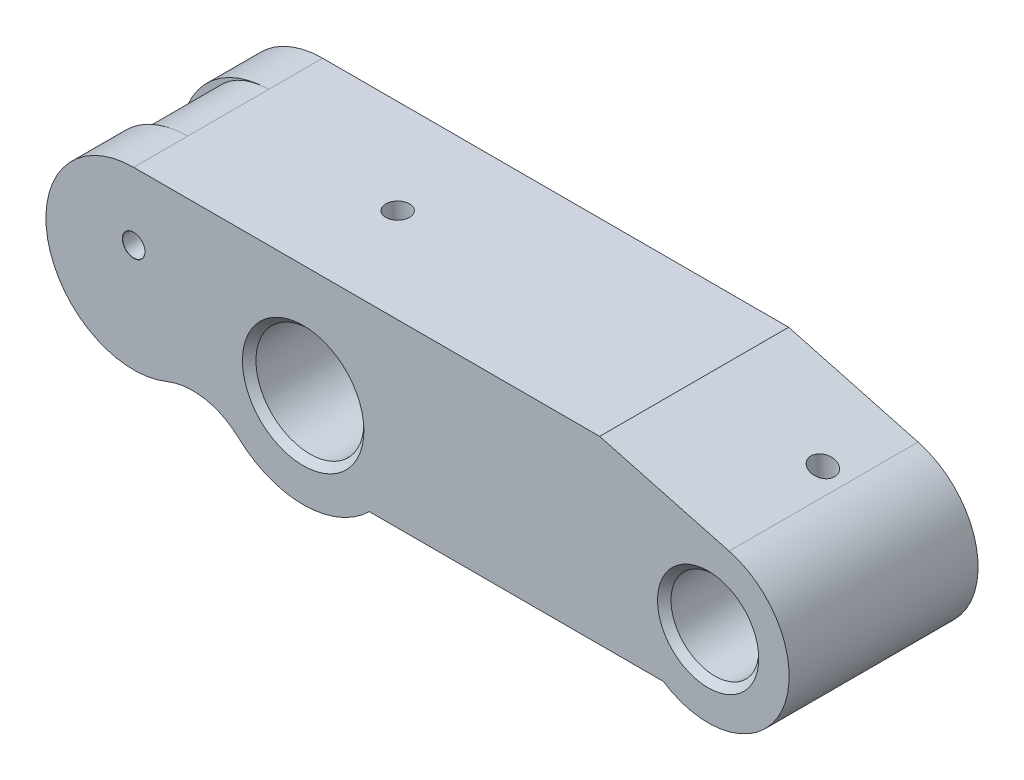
ISO-10303-21;
HEADER;
FILE_DESCRIPTION(('STEP AP214'),'2;1');
FILE_NAME('part.step','',(''),(''),'','','');
FILE_SCHEMA(('AUTOMOTIVE_DESIGN { 1 0 10303 214 1 1 1 1 }'));
ENDSEC;
DATA;
#1=APPLICATION_CONTEXT('core data for automotive mechanical design processes');
#2=APPLICATION_PROTOCOL_DEFINITION('international standard','automotive_design',2000,#1);
#3=PRODUCT_CONTEXT('',#1,'mechanical');
#4=PRODUCT('Part','Part','',(#3));
#5=PRODUCT_RELATED_PRODUCT_CATEGORY('part','',(#4));
#6=PRODUCT_DEFINITION_FORMATION('','',#4);
#7=PRODUCT_DEFINITION_CONTEXT('part definition',#1,'design');
#8=PRODUCT_DEFINITION('design','',#6,#7);
#9=PRODUCT_DEFINITION_SHAPE('','',#8);
#10=(LENGTH_UNIT() NAMED_UNIT(*) SI_UNIT(.MILLI.,.METRE.));
#11=(NAMED_UNIT(*) PLANE_ANGLE_UNIT() SI_UNIT($,.RADIAN.));
#12=(NAMED_UNIT(*) SI_UNIT($,.STERADIAN.) SOLID_ANGLE_UNIT());
#13=UNCERTAINTY_MEASURE_WITH_UNIT(LENGTH_MEASURE(1.E-05),#10,'distance_accuracy_value','');
#14=(GEOMETRIC_REPRESENTATION_CONTEXT(3) GLOBAL_UNCERTAINTY_ASSIGNED_CONTEXT((#13)) GLOBAL_UNIT_ASSIGNED_CONTEXT((#10,
#11,#12)) REPRESENTATION_CONTEXT('',''));
#15=CARTESIAN_POINT('',(0.,0.,0.));
#16=DIRECTION('',(0.,0.,1.));
#17=DIRECTION('',(1.,0.,0.));
#18=AXIS2_PLACEMENT_3D('',#15,#16,#17);
#19=CARTESIAN_POINT('',(-25.1140714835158,6.72929517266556,14.));
#20=DIRECTION('',(0.,0.,-1.));
#21=DIRECTION('',(-1.,0.,0.));
#22=AXIS2_PLACEMENT_3D('',#19,#20,#21);
#23=CYLINDRICAL_SURFACE('',#22,10.);
#24=CARTESIAN_POINT('',(-25.1140714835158,6.72929517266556,-6.));
#25=DIRECTION('',(0.,0.,1.));
#26=DIRECTION('',(1.,0.,0.));
#27=AXIS2_PLACEMENT_3D('',#24,#25,#26);
#28=CIRCLE('',#27,10.);
#29=CARTESIAN_POINT('',(-25.1140714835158,16.7292951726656,-6.));
#30=VERTEX_POINT('',#29);
#31=CARTESIAN_POINT('',(-22.7396447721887,-2.98472036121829,-6.));
#32=VERTEX_POINT('',#31);
#33=EDGE_CURVE('E146',#30,#32,#28,.T.);
#34=ORIENTED_EDGE('',*,*,#33,.T.);
#35=DIRECTION('',(0.,0.,-1.));
#36=VECTOR('',#35,1.);
#37=CARTESIAN_POINT('',(-22.7396447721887,-2.98472036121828,14.));
#38=LINE('',#37,#36);
#39=CARTESIAN_POINT('',(-22.7396447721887,-2.98472036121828,6.));
#40=VERTEX_POINT('',#39);
#41=EDGE_CURVE('E228',#40,#32,#38,.T.);
#42=ORIENTED_EDGE('',*,*,#41,.F.);
#43=CARTESIAN_POINT('',(-25.1140714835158,6.72929517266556,6.));
#44=DIRECTION('',(0.,0.,1.));
#45=DIRECTION('',(1.,0.,0.));
#46=AXIS2_PLACEMENT_3D('',#43,#44,#45);
#47=CIRCLE('',#46,10.);
#48=CARTESIAN_POINT('',(-25.1140714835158,16.7292951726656,6.));
#49=VERTEX_POINT('',#48);
#50=EDGE_CURVE('E186',#49,#40,#47,.T.);
#51=ORIENTED_EDGE('',*,*,#50,.F.);
#52=DIRECTION('',(0.,0.,-1.));
#53=VECTOR('',#52,1.);
#54=CARTESIAN_POINT('',(-25.1140714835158,16.7292951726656,14.));
#55=LINE('',#54,#53);
#56=EDGE_CURVE('E226',#49,#30,#55,.T.);
#57=ORIENTED_EDGE('',*,*,#56,.T.);
#58=EDGE_LOOP('',(#34,#42,#51,#57));
#59=FACE_BOUND('',#58,.T.);
#60=ADVANCED_FACE('F44',(#59),#23,.T.);
#61=CARTESIAN_POINT('',(-20.3652180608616,-12.6987358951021,14.));
#62=DIRECTION('',(0.,0.,-1.));
#63=DIRECTION('',(-1.,0.,0.));
#64=AXIS2_PLACEMENT_3D('',#61,#62,#63);
#65=CYLINDRICAL_SURFACE('',#64,10.);
#66=CARTESIAN_POINT('',(-20.3652180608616,-12.6987358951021,-6.));
#67=DIRECTION('',(0.,0.,1.));
#68=DIRECTION('',(1.,0.,0.));
#69=AXIS2_PLACEMENT_3D('',#66,#67,#68);
#70=CIRCLE('',#69,10.);
#71=CARTESIAN_POINT('',(-11.8797105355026,-7.40759593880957,-6.));
#72=VERTEX_POINT('',#71);
#73=EDGE_CURVE('E77',#32,#72,#70,.F.);
#74=ORIENTED_EDGE('',*,*,#73,.T.);
#75=DIRECTION('',(0.,0.,-1.));
#76=VECTOR('',#75,1.);
#77=CARTESIAN_POINT('',(-11.8797105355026,-7.40759593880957,14.));
#78=LINE('',#77,#76);
#79=CARTESIAN_POINT('',(-11.8797105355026,-7.40759593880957,6.));
#80=VERTEX_POINT('',#79);
#81=EDGE_CURVE('E219',#80,#72,#78,.T.);
#82=ORIENTED_EDGE('',*,*,#81,.F.);
#83=CARTESIAN_POINT('',(-20.3652180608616,-12.6987358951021,6.));
#84=DIRECTION('',(0.,0.,1.));
#85=DIRECTION('',(1.,0.,0.));
#86=AXIS2_PLACEMENT_3D('',#83,#84,#85);
#87=CIRCLE('',#86,10.);
#88=EDGE_CURVE('E187',#40,#80,#87,.F.);
#89=ORIENTED_EDGE('',*,*,#88,.F.);
#90=ORIENTED_EDGE('',*,*,#41,.T.);
#91=EDGE_LOOP('',(#74,#82,#89,#90));
#92=FACE_BOUND('',#91,.T.);
#93=ADVANCED_FACE('F350',(#92),#65,.F.);
#94=CARTESIAN_POINT('',(0.,0.,14.));
#95=DIRECTION('',(0.,0.,-1.));
#96=DIRECTION('',(-1.,0.,0.));
#97=AXIS2_PLACEMENT_3D('',#94,#95,#96);
#98=CYLINDRICAL_SURFACE('',#97,14.);
#99=ORIENTED_EDGE('',*,*,#81,.T.);
#100=CARTESIAN_POINT('',(0.,0.,-6.));
#101=DIRECTION('',(0.,0.,1.));
#102=DIRECTION('',(1.,0.,0.));
#103=AXIS2_PLACEMENT_3D('',#100,#101,#102);
#104=CIRCLE('',#103,14.);
#105=CARTESIAN_POINT('',(-9.55214689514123,-10.2350617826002,-6.));
#106=VERTEX_POINT('',#105);
#107=EDGE_CURVE('E70',#72,#106,#104,.T.);
#108=ORIENTED_EDGE('',*,*,#107,.T.);
#109=DIRECTION('',(0.,0.,-1.));
#110=VECTOR('',#109,1.);
#111=CARTESIAN_POINT('',(-9.55214689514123,-10.2350617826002,-6.));
#112=LINE('',#111,#110);
#113=CARTESIAN_POINT('',(-9.55214689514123,-10.2350617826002,-14.));
#114=VERTEX_POINT('',#113);
#115=EDGE_CURVE('E165',#106,#114,#112,.T.);
#116=ORIENTED_EDGE('',*,*,#115,.T.);
#117=CARTESIAN_POINT('',(0.,0.,-14.));
#118=DIRECTION('',(0.,0.,1.));
#119=DIRECTION('',(1.,0.,0.));
#120=AXIS2_PLACEMENT_3D('',#117,#118,#119);
#121=CIRCLE('',#120,14.);
#122=CARTESIAN_POINT('',(9.79795897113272,-10.,-14.));
#123=VERTEX_POINT('',#122);
#124=EDGE_CURVE('E201',#114,#123,#121,.T.);
#125=ORIENTED_EDGE('',*,*,#124,.T.);
#126=DIRECTION('',(0.,0.,-1.));
#127=VECTOR('',#126,1.);
#128=CARTESIAN_POINT('',(9.79795897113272,-10.,14.));
#129=LINE('',#128,#127);
#130=CARTESIAN_POINT('',(9.79795897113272,-10.,14.));
#131=VERTEX_POINT('',#130);
#132=EDGE_CURVE('E241',#131,#123,#129,.T.);
#133=ORIENTED_EDGE('',*,*,#132,.F.);
#134=CARTESIAN_POINT('',(0.,0.,14.));
#135=DIRECTION('',(0.,0.,1.));
#136=DIRECTION('',(1.,0.,0.));
#137=AXIS2_PLACEMENT_3D('',#134,#135,#136);
#138=CIRCLE('',#137,14.);
#139=CARTESIAN_POINT('',(-9.55214689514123,-10.2350617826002,14.));
#140=VERTEX_POINT('',#139);
#141=EDGE_CURVE('E202',#140,#131,#138,.T.);
#142=ORIENTED_EDGE('',*,*,#141,.F.);
#143=DIRECTION('',(0.,0.,1.));
#144=VECTOR('',#143,1.);
#145=CARTESIAN_POINT('',(-9.55214689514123,-10.2350617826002,6.));
#146=LINE('',#145,#144);
#147=CARTESIAN_POINT('',(-9.55214689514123,-10.2350617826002,6.));
#148=VERTEX_POINT('',#147);
#149=EDGE_CURVE('E193',#148,#140,#146,.T.);
#150=ORIENTED_EDGE('',*,*,#149,.F.);
#151=CARTESIAN_POINT('',(0.,0.,6.));
#152=DIRECTION('',(0.,0.,1.));
#153=DIRECTION('',(1.,0.,0.));
#154=AXIS2_PLACEMENT_3D('',#151,#152,#153);
#155=CIRCLE('',#154,14.);
#156=EDGE_CURVE('E185',#80,#148,#155,.T.);
#157=ORIENTED_EDGE('',*,*,#156,.F.);
#158=EDGE_LOOP('',(#99,#108,#116,#125,#133,#142,#150,#157));
#159=FACE_BOUND('',#158,.T.);
#160=ADVANCED_FACE('F353',(#159),#98,.T.);
#161=CARTESIAN_POINT('',(0.,0.,14.));
#162=DIRECTION('',(0.,0.,1.));
#163=DIRECTION('',(1.,0.,0.));
#164=AXIS2_PLACEMENT_3D('',#161,#162,#163);
#165=PLANE('',#164);
#166=CARTESIAN_POINT('',(-25.1140714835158,6.72929517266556,14.));
#167=DIRECTION('',(0.,0.,1.));
#168=DIRECTION('',(1.,0.,0.));
#169=AXIS2_PLACEMENT_3D('',#166,#167,#168);
#170=CIRCLE('',#169,1.675);
#171=CARTESIAN_POINT('',(-23.4390714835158,6.72929517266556,14.));
#172=VERTEX_POINT('',#171);
#173=EDGE_CURVE('E270',#172,#172,#170,.T.);
#174=ORIENTED_EDGE('',*,*,#173,.F.);
#175=EDGE_LOOP('',(#174));
#176=FACE_BOUND('',#175,.T.);
#177=CARTESIAN_POINT('',(-16.3751089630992,-17.5458201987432,14.));
#178=DIRECTION('',(0.,0.,1.));
#179=DIRECTION('',(1.,0.,0.));
#180=AXIS2_PLACEMENT_3D('',#177,#178,#179);
#181=CIRCLE('',#180,10.);
#182=CARTESIAN_POINT('',(-20.1746578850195,-8.29577003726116,14.));
#183=VERTEX_POINT('',#182);
#184=EDGE_CURVE('E178',#140,#183,#181,.T.);
#185=ORIENTED_EDGE('',*,*,#184,.F.);
#186=ORIENTED_EDGE('',*,*,#141,.T.);
#187=DIRECTION('',(1.,0.,0.));
#188=VECTOR('',#187,1.);
#189=CARTESIAN_POINT('',(9.79795897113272,-10.,14.));
#190=LINE('',#189,#188);
#191=CARTESIAN_POINT('',(53.3667504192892,-10.,14.));
#192=VERTEX_POINT('',#191);
#193=EDGE_CURVE('E210',#131,#192,#190,.T.);
#194=ORIENTED_EDGE('',*,*,#193,.T.);
#195=CARTESIAN_POINT('',(60.,0.,14.));
#196=DIRECTION('',(0.,0.,1.));
#197=DIRECTION('',(1.,0.,0.));
#198=AXIS2_PLACEMENT_3D('',#195,#196,#197);
#199=CIRCLE('',#198,12.);
#200=CARTESIAN_POINT('',(63.1058285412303,11.5911099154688,14.));
#201=VERTEX_POINT('',#200);
#202=EDGE_CURVE('E208',#192,#201,#199,.T.);
#203=ORIENTED_EDGE('',*,*,#202,.T.);
#204=DIRECTION('',(-0.965925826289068,0.258819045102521,0.));
#205=VECTOR('',#204,1.);
#206=CARTESIAN_POINT('',(43.9298601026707,16.7292951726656,14.));
#207=LINE('',#206,#205);
#208=CARTESIAN_POINT('',(43.9298601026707,16.7292951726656,14.));
#209=VERTEX_POINT('',#208);
#210=EDGE_CURVE('E215',#201,#209,#207,.T.);
#211=ORIENTED_EDGE('',*,*,#210,.T.);
#212=DIRECTION('',(-1.,0.,0.));
#213=VECTOR('',#212,1.);
#214=CARTESIAN_POINT('',(-25.1140714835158,16.7292951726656,14.));
#215=LINE('',#214,#213);
#216=CARTESIAN_POINT('',(-25.1140714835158,16.7292951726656,14.));
#217=VERTEX_POINT('',#216);
#218=EDGE_CURVE('E211',#209,#217,#215,.T.);
#219=ORIENTED_EDGE('',*,*,#218,.T.);
#220=CARTESIAN_POINT('',(-25.1140714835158,3.72929517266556,14.));
#221=DIRECTION('',(0.,0.,1.));
#222=DIRECTION('',(1.,0.,0.));
#223=AXIS2_PLACEMENT_3D('',#220,#221,#222);
#224=CIRCLE('',#223,13.);
#225=EDGE_CURVE('E182',#217,#183,#224,.T.);
#226=ORIENTED_EDGE('',*,*,#225,.T.);
#227=EDGE_LOOP('',(#185,#186,#194,#203,#211,#219,#226));
#228=FACE_BOUND('',#227,.T.);
#229=CARTESIAN_POINT('',(60.,0.,14.));
#230=DIRECTION('',(0.,0.,1.));
#231=DIRECTION('',(1.,0.,0.));
#232=AXIS2_PLACEMENT_3D('',#229,#230,#231);
#233=CIRCLE('',#232,7.49999999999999);
#234=CARTESIAN_POINT('',(67.5,0.,14.));
#235=VERTEX_POINT('',#234);
#236=EDGE_CURVE('E254',#235,#235,#233,.F.);
#237=ORIENTED_EDGE('',*,*,#236,.T.);
#238=EDGE_LOOP('',(#237));
#239=FACE_BOUND('',#238,.T.);
#240=CARTESIAN_POINT('',(0.,0.,14.));
#241=DIRECTION('',(0.,0.,1.));
#242=DIRECTION('',(1.,0.,0.));
#243=AXIS2_PLACEMENT_3D('',#240,#241,#242);
#244=CIRCLE('',#243,9.00000000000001);
#245=CARTESIAN_POINT('',(9.00000000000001,0.,14.));
#246=VERTEX_POINT('',#245);
#247=EDGE_CURVE('E249',#246,#246,#244,.F.);
#248=ORIENTED_EDGE('',*,*,#247,.T.);
#249=EDGE_LOOP('',(#248));
#250=FACE_BOUND('',#249,.T.);
#251=ADVANCED_FACE('F376',(#176,#228,#239,#250),#165,.T.);
#252=CARTESIAN_POINT('',(0.,0.,-14.));
#253=DIRECTION('',(0.,0.,1.));
#254=DIRECTION('',(1.,0.,0.));
#255=AXIS2_PLACEMENT_3D('',#252,#253,#254);
#256=PLANE('',#255);
#257=CARTESIAN_POINT('',(-25.1140714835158,6.72929517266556,-14.));
#258=DIRECTION('',(0.,0.,-1.));
#259=DIRECTION('',(-1.,0.,0.));
#260=AXIS2_PLACEMENT_3D('',#257,#258,#259);
#261=CIRCLE('',#260,1.675);
#262=CARTESIAN_POINT('',(-26.7890714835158,6.72929517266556,-14.));
#263=VERTEX_POINT('',#262);
#264=EDGE_CURVE('E280',#263,#263,#261,.T.);
#265=ORIENTED_EDGE('',*,*,#264,.F.);
#266=EDGE_LOOP('',(#265));
#267=FACE_BOUND('',#266,.T.);
#268=ORIENTED_EDGE('',*,*,#124,.F.);
#269=CARTESIAN_POINT('',(-16.3751089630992,-17.5458201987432,-14.));
#270=DIRECTION('',(0.,0.,1.));
#271=DIRECTION('',(1.,0.,0.));
#272=AXIS2_PLACEMENT_3D('',#269,#270,#271);
#273=CIRCLE('',#272,10.);
#274=CARTESIAN_POINT('',(-20.1746578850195,-8.29577003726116,-14.));
#275=VERTEX_POINT('',#274);
#276=EDGE_CURVE('E168',#114,#275,#273,.T.);
#277=ORIENTED_EDGE('',*,*,#276,.T.);
#278=CARTESIAN_POINT('',(-25.1140714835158,3.72929517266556,-14.));
#279=DIRECTION('',(0.,0.,1.));
#280=DIRECTION('',(1.,0.,0.));
#281=AXIS2_PLACEMENT_3D('',#278,#279,#280);
#282=CIRCLE('',#281,13.);
#283=CARTESIAN_POINT('',(-25.1140714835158,16.7292951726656,-14.));
#284=VERTEX_POINT('',#283);
#285=EDGE_CURVE('E156',#284,#275,#282,.T.);
#286=ORIENTED_EDGE('',*,*,#285,.F.);
#287=DIRECTION('',(-1.,0.,0.));
#288=VECTOR('',#287,1.);
#289=CARTESIAN_POINT('',(-25.1140714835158,16.7292951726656,-14.));
#290=LINE('',#289,#288);
#291=CARTESIAN_POINT('',(43.9298601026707,16.7292951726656,-14.));
#292=VERTEX_POINT('',#291);
#293=EDGE_CURVE('E206',#292,#284,#290,.T.);
#294=ORIENTED_EDGE('',*,*,#293,.F.);
#295=DIRECTION('',(-0.965925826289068,0.258819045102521,0.));
#296=VECTOR('',#295,1.);
#297=CARTESIAN_POINT('',(43.9298601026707,16.7292951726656,-14.));
#298=LINE('',#297,#296);
#299=CARTESIAN_POINT('',(63.1058285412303,11.5911099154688,-14.));
#300=VERTEX_POINT('',#299);
#301=EDGE_CURVE('E221',#300,#292,#298,.T.);
#302=ORIENTED_EDGE('',*,*,#301,.F.);
#303=CARTESIAN_POINT('',(60.,0.,-14.));
#304=DIRECTION('',(0.,0.,1.));
#305=DIRECTION('',(1.,0.,0.));
#306=AXIS2_PLACEMENT_3D('',#303,#304,#305);
#307=CIRCLE('',#306,12.);
#308=CARTESIAN_POINT('',(53.3667504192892,-10.,-14.));
#309=VERTEX_POINT('',#308);
#310=EDGE_CURVE('E217',#309,#300,#307,.T.);
#311=ORIENTED_EDGE('',*,*,#310,.F.);
#312=DIRECTION('',(1.,0.,0.));
#313=VECTOR('',#312,1.);
#314=CARTESIAN_POINT('',(9.79795897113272,-10.,-14.));
#315=LINE('',#314,#313);
#316=EDGE_CURVE('E220',#123,#309,#315,.T.);
#317=ORIENTED_EDGE('',*,*,#316,.F.);
#318=EDGE_LOOP('',(#268,#277,#286,#294,#302,#311,#317));
#319=FACE_BOUND('',#318,.T.);
#320=CARTESIAN_POINT('',(60.,0.,-14.));
#321=DIRECTION('',(0.,0.,1.));
#322=DIRECTION('',(1.,0.,0.));
#323=AXIS2_PLACEMENT_3D('',#320,#321,#322);
#324=CIRCLE('',#323,7.49999999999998);
#325=CARTESIAN_POINT('',(67.5,0.,-14.));
#326=VERTEX_POINT('',#325);
#327=EDGE_CURVE('E256',#326,#326,#324,.T.);
#328=ORIENTED_EDGE('',*,*,#327,.T.);
#329=EDGE_LOOP('',(#328));
#330=FACE_BOUND('',#329,.T.);
#331=CARTESIAN_POINT('',(0.,0.,-14.));
#332=DIRECTION('',(0.,0.,1.));
#333=DIRECTION('',(1.,0.,0.));
#334=AXIS2_PLACEMENT_3D('',#331,#332,#333);
#335=CIRCLE('',#334,9.00000000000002);
#336=CARTESIAN_POINT('',(9.00000000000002,0.,-14.));
#337=VERTEX_POINT('',#336);
#338=EDGE_CURVE('E257',#337,#337,#335,.T.);
#339=ORIENTED_EDGE('',*,*,#338,.T.);
#340=EDGE_LOOP('',(#339));
#341=FACE_BOUND('',#340,.T.);
#342=ADVANCED_FACE('F375',(#267,#319,#330,#341),#256,.F.);
#343=CARTESIAN_POINT('',(9.79795897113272,-10.,14.));
#344=DIRECTION('',(0.,1.,0.));
#345=DIRECTION('',(0.,0.,1.));
#346=AXIS2_PLACEMENT_3D('',#343,#344,#345);
#347=PLANE('',#346);
#348=ORIENTED_EDGE('',*,*,#316,.T.);
#349=DIRECTION('',(0.,0.,-1.));
#350=VECTOR('',#349,1.);
#351=CARTESIAN_POINT('',(53.3667504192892,-10.,14.));
#352=LINE('',#351,#350);
#353=EDGE_CURVE('E238',#192,#309,#352,.T.);
#354=ORIENTED_EDGE('',*,*,#353,.F.);
#355=ORIENTED_EDGE('',*,*,#193,.F.);
#356=ORIENTED_EDGE('',*,*,#132,.T.);
#357=EDGE_LOOP('',(#348,#354,#355,#356));
#358=FACE_BOUND('',#357,.T.);
#359=ADVANCED_FACE('F368',(#358),#347,.F.);
#360=CARTESIAN_POINT('',(60.,0.,14.));
#361=DIRECTION('',(0.,0.,-1.));
#362=DIRECTION('',(-1.,0.,0.));
#363=AXIS2_PLACEMENT_3D('',#360,#361,#362);
#364=CYLINDRICAL_SURFACE('',#363,12.);
#365=ORIENTED_EDGE('',*,*,#310,.T.);
#366=DIRECTION('',(0.,0.,-1.));
#367=VECTOR('',#366,1.);
#368=CARTESIAN_POINT('',(63.1058285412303,11.5911099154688,14.));
#369=LINE('',#368,#367);
#370=EDGE_CURVE('E232',#201,#300,#369,.T.);
#371=ORIENTED_EDGE('',*,*,#370,.F.);
#372=ORIENTED_EDGE('',*,*,#202,.F.);
#373=ORIENTED_EDGE('',*,*,#353,.T.);
#374=EDGE_LOOP('',(#365,#371,#372,#373));
#375=FACE_BOUND('',#374,.T.);
#376=ADVANCED_FACE('F364',(#375),#364,.T.);
#377=CARTESIAN_POINT('',(43.9298601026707,16.7292951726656,14.));
#378=DIRECTION('',(-0.258819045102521,-0.965925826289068,0.));
#379=DIRECTION('',(0.965925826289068,-0.258819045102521,0.));
#380=AXIS2_PLACEMENT_3D('',#377,#378,#379);
#381=PLANE('',#380);
#382=CARTESIAN_POINT('',(60.,12.423314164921,-3.));
#383=DIRECTION('',(-0.258819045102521,-0.965925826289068,0.));
#384=DIRECTION('',(-0.965925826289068,0.258819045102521,0.));
#385=AXIS2_PLACEMENT_3D('',#382,#383,#384);
#386=ELLIPSE('',#385,1.81173331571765,1.75);
#387=CARTESIAN_POINT('',(58.25,12.8922252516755,-3.));
#388=VERTEX_POINT('',#387);
#389=EDGE_CURVE('E476',#388,#388,#386,.T.);
#390=ORIENTED_EDGE('',*,*,#389,.T.);
#391=EDGE_LOOP('',(#390));
#392=FACE_BOUND('',#391,.T.);
#393=ORIENTED_EDGE('',*,*,#301,.T.);
#394=DIRECTION('',(0.,0.,-1.));
#395=VECTOR('',#394,1.);
#396=CARTESIAN_POINT('',(43.9298601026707,16.7292951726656,14.));
#397=LINE('',#396,#395);
#398=EDGE_CURVE('E235',#209,#292,#397,.T.);
#399=ORIENTED_EDGE('',*,*,#398,.F.);
#400=ORIENTED_EDGE('',*,*,#210,.F.);
#401=ORIENTED_EDGE('',*,*,#370,.T.);
#402=EDGE_LOOP('',(#393,#399,#400,#401));
#403=FACE_BOUND('',#402,.T.);
#404=ADVANCED_FACE('F359',(#392,#403),#381,.F.);
#405=CARTESIAN_POINT('',(-25.1140714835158,16.7292951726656,14.));
#406=DIRECTION('',(0.,-1.,0.));
#407=DIRECTION('',(0.,0.,-1.));
#408=AXIS2_PLACEMENT_3D('',#405,#406,#407);
#409=PLANE('',#408);
#410=CARTESIAN_POINT('',(0.,16.7292951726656,0.));
#411=DIRECTION('',(0.,1.,0.));
#412=DIRECTION('',(0.,0.,1.));
#413=AXIS2_PLACEMENT_3D('',#410,#411,#412);
#414=CIRCLE('',#413,1.75);
#415=CARTESIAN_POINT('',(0.,16.7292951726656,1.75));
#416=VERTEX_POINT('',#415);
#417=EDGE_CURVE('E279',#416,#416,#414,.T.);
#418=ORIENTED_EDGE('',*,*,#417,.F.);
#419=EDGE_LOOP('',(#418));
#420=FACE_BOUND('',#419,.T.);
#421=ORIENTED_EDGE('',*,*,#293,.T.);
#422=DIRECTION('',(0.,0.,-1.));
#423=VECTOR('',#422,1.);
#424=CARTESIAN_POINT('',(-25.1140714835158,16.7292951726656,-6.));
#425=LINE('',#424,#423);
#426=EDGE_CURVE('E163',#30,#284,#425,.T.);
#427=ORIENTED_EDGE('',*,*,#426,.F.);
#428=ORIENTED_EDGE('',*,*,#56,.F.);
#429=EDGE_CURVE('E230',#217,#49,#55,.T.);
#430=ORIENTED_EDGE('',*,*,#429,.F.);
#431=ORIENTED_EDGE('',*,*,#218,.F.);
#432=ORIENTED_EDGE('',*,*,#398,.T.);
#433=EDGE_LOOP('',(#421,#427,#428,#430,#431,#432));
#434=FACE_BOUND('',#433,.T.);
#435=ADVANCED_FACE('F344',(#420,#434),#409,.F.);
#436=CARTESIAN_POINT('',(0.,0.,14.));
#437=DIRECTION('',(0.,0.,-1.));
#438=DIRECTION('',(-1.,0.,0.));
#439=AXIS2_PLACEMENT_3D('',#436,#437,#438);
#440=CYLINDRICAL_SURFACE('',#439,8.);
#441=CARTESIAN_POINT('',(0.,8.,1.75));
#442=CARTESIAN_POINT('',(-0.0970593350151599,7.99999820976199,1.74999668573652));
#443=CARTESIAN_POINT('',(-0.194158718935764,7.99821570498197,1.74189801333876));
#444=CARTESIAN_POINT('',(-0.385599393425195,7.99127711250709,1.70975094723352));
#445=CARTESIAN_POINT('',(-0.479938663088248,7.98611861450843,1.68569115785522));
#446=CARTESIAN_POINT('',(-0.663064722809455,7.973002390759,1.62241151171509));
#447=CARTESIAN_POINT('',(-0.751857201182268,7.96504759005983,1.58320749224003));
#448=CARTESIAN_POINT('',(-0.921601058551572,7.94719730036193,1.49080250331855));
#449=CARTESIAN_POINT('',(-1.00255264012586,7.93730186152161,1.4376018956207));
#450=CARTESIAN_POINT('',(-1.15561917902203,7.91647673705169,1.31781028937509));
#451=CARTESIAN_POINT('',(-1.22759027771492,7.90553422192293,1.25103768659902));
#452=CARTESIAN_POINT('',(-1.3594054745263,7.88393863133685,1.10638738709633));
#453=CARTESIAN_POINT('',(-1.41924849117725,7.87328558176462,1.02850870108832));
#454=CARTESIAN_POINT('',(-1.52574354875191,7.85334859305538,0.862793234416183));
#455=CARTESIAN_POINT('',(-1.57224243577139,7.84408109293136,0.774855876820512));
#456=CARTESIAN_POINT('',(-1.64974688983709,7.82814863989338,0.59217915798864));
#457=CARTESIAN_POINT('',(-1.68075430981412,7.82148337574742,0.497440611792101));
#458=CARTESIAN_POINT('',(-1.72592019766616,7.8116407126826,0.305411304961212));
#459=CARTESIAN_POINT('',(-1.74033336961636,7.80841064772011,0.208183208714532));
#460=CARTESIAN_POINT('',(-1.75269359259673,7.80564592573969,0.0126394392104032));
#461=CARTESIAN_POINT('',(-1.75064266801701,7.80611081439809,-0.0856760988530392));
#462=CARTESIAN_POINT('',(-1.73033788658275,7.81063579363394,-0.278710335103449));
#463=CARTESIAN_POINT('',(-1.71237992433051,7.81463022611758,-0.373461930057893));
#464=CARTESIAN_POINT('',(-1.66123961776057,7.82566041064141,-0.558574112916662));
#465=CARTESIAN_POINT('',(-1.62805641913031,7.83269633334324,-0.648934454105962));
#466=CARTESIAN_POINT('',(-1.54713590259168,7.84908142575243,-0.823530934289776));
#467=CARTESIAN_POINT('',(-1.49928481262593,7.85844856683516,-0.907712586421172));
#468=CARTESIAN_POINT('',(-1.39046682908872,7.87842963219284,-1.06696091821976));
#469=CARTESIAN_POINT('',(-1.32949814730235,7.88904372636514,-1.14202635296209));
#470=CARTESIAN_POINT('',(-1.19460937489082,7.91060446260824,-1.28261496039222));
#471=CARTESIAN_POINT('',(-1.12043767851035,7.92155333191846,-1.34789662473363));
#472=CARTESIAN_POINT('',(-0.962075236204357,7.94234089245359,-1.46513376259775));
#473=CARTESIAN_POINT('',(-0.877884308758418,7.95217956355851,-1.51708899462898));
#474=CARTESIAN_POINT('',(-0.701578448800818,7.96967012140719,-1.60625815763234));
#475=CARTESIAN_POINT('',(-0.609447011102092,7.97731730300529,-1.64344043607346));
#476=CARTESIAN_POINT('',(-0.420039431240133,7.98952827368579,-1.70172886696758));
#477=CARTESIAN_POINT('',(-0.322764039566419,7.99409251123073,-1.72283735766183));
#478=CARTESIAN_POINT('',(-0.127901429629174,7.99955949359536,-1.74802773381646));
#479=CARTESIAN_POINT('',(-0.0303587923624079,8.00053317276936,-1.75243952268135));
#480=CARTESIAN_POINT('',(0.164069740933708,7.99890811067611,-1.74500545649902));
#481=CARTESIAN_POINT('',(0.260955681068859,7.9963096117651,-1.73316070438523));
#482=CARTESIAN_POINT('',(0.450227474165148,7.98787693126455,-1.69382333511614));
#483=CARTESIAN_POINT('',(0.542651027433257,7.98207854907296,-1.66650375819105));
#484=CARTESIAN_POINT('',(0.721603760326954,7.96789511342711,-1.59718431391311));
#485=CARTESIAN_POINT('',(0.808132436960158,7.95950983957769,-1.55518319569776));
#486=CARTESIAN_POINT('',(0.974203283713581,7.94090779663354,-1.45700558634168));
#487=CARTESIAN_POINT('',(1.05362808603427,7.93066659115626,-1.40063529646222));
#488=CARTESIAN_POINT('',(1.20200932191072,7.90953858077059,-1.27557468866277));
#489=CARTESIAN_POINT('',(1.2709643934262,7.898651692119,-1.20688277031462));
#490=CARTESIAN_POINT('',(1.39775310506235,7.87721432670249,-1.05761497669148));
#491=CARTESIAN_POINT('',(1.45535830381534,7.86667375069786,-0.976843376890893));
#492=CARTESIAN_POINT('',(1.55618726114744,7.84735161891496,-0.806578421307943));
#493=CARTESIAN_POINT('',(1.5994116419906,7.83856998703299,-0.717085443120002));
#494=CARTESIAN_POINT('',(1.66996009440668,7.82384388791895,-0.532397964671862));
#495=CARTESIAN_POINT('',(1.69737356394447,7.81788350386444,-0.437238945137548));
#496=CARTESIAN_POINT('',(1.73578387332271,7.80944608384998,-0.243517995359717));
#497=CARTESIAN_POINT('',(1.74678333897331,7.80696849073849,-0.144956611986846));
#498=CARTESIAN_POINT('',(1.75194163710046,7.80581228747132,0.0504679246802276));
#499=CARTESIAN_POINT('',(1.74646267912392,7.80705196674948,0.147321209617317));
#500=CARTESIAN_POINT('',(1.7196294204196,7.81300583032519,0.338688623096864));
#501=CARTESIAN_POINT('',(1.69827530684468,7.81771997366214,0.433202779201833));
#502=CARTESIAN_POINT('',(1.64047291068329,7.83005176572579,0.616921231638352));
#503=CARTESIAN_POINT('',(1.60407735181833,7.83765926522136,0.706142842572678));
#504=CARTESIAN_POINT('',(1.51727048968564,7.85492457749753,0.877267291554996));
#505=CARTESIAN_POINT('',(1.46685772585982,7.86458260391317,0.959169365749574));
#506=CARTESIAN_POINT('',(1.35224615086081,7.88510483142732,1.11511534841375));
#507=CARTESIAN_POINT('',(1.28778921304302,7.89598947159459,1.18896689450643));
#508=CARTESIAN_POINT('',(1.14744205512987,7.91760116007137,1.32492424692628));
#509=CARTESIAN_POINT('',(1.07154919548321,7.92832817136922,1.3870273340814));
#510=CARTESIAN_POINT('',(0.909297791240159,7.948581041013,1.49849633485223));
#511=CARTESIAN_POINT('',(0.822816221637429,7.95808950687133,1.54768651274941));
#512=CARTESIAN_POINT('',(0.642622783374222,7.97465942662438,1.63075470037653));
#513=CARTESIAN_POINT('',(0.548917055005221,7.98172293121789,1.66464554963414));
#514=CARTESIAN_POINT('',(0.379265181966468,7.99134698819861,1.71011403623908));
#515=CARTESIAN_POINT('',(0.304236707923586,7.99457176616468,1.72504272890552));
#516=CARTESIAN_POINT('',(0.152813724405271,7.99889892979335,1.74498679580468));
#517=CARTESIAN_POINT('',(0.0764192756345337,8.00000140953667,1.75000260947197));
#518=CARTESIAN_POINT('',(0.,8.,1.75));
#519=B_SPLINE_CURVE_WITH_KNOTS('',3,(#441,#442,#443,#444,#445,#446,#447,#448,#449,#450,#451,
#452,#453,#454,#455,#456,#457,#458,#459,#460,#461,#462,#463,#464,#465,#466,#467,#468,#469,#470,
#471,#472,#473,#474,#475,#476,#477,#478,#479,#480,#481,#482,#483,#484,#485,#486,#487,#488,#489,
#490,#491,#492,#493,#494,#495,#496,#497,#498,#499,#500,#501,#502,#503,#504,#505,#506,#507,#508,
#509,#510,#511,#512,#513,#514,#515,#516,#517,#518),.UNSPECIFIED.,.T.,.F.,(4,2,2,2,2,2,2,2,2,2,2,
2,2,2,2,2,2,2,2,2,2,2,2,2,2,2,2,2,2,2,2,2,2,2,2,2,2,2,4),(0.,0.290898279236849,
0.582004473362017,0.872807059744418,1.16360213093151,1.45858009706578,1.7535843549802,
2.05185017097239,2.3500803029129,2.64366919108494,2.93722198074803,3.2254263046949,
3.51364680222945,3.80416202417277,4.0947168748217,4.39155618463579,4.6884008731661,
4.9858781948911,5.28331223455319,5.5748377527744,5.86634349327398,6.15465219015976,
6.44298545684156,6.73543477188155,7.02792210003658,7.32580107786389,7.6236671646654,
7.9198321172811,8.21594968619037,8.50560626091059,8.79525942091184,9.08390577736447,
9.37258222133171,9.66709530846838,9.96167647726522,10.2600801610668,10.5582329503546,
10.7872806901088,11.0163182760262),.UNSPECIFIED.);
#520=CARTESIAN_POINT('',(0.,8.,1.75));
#521=VERTEX_POINT('',#520);
#522=EDGE_CURVE('E267',#521,#521,#519,.T.);
#523=ORIENTED_EDGE('',*,*,#522,.F.);
#524=EDGE_LOOP('',(#523));
#525=FACE_BOUND('',#524,.T.);
#526=CARTESIAN_POINT('',(0.,0.,-13.));
#527=DIRECTION('',(0.,0.,1.));
#528=DIRECTION('',(1.,0.,0.));
#529=AXIS2_PLACEMENT_3D('',#526,#527,#528);
#530=CIRCLE('',#529,8.);
#531=CARTESIAN_POINT('',(8.,0.,-13.));
#532=VERTEX_POINT('',#531);
#533=EDGE_CURVE('E11',#532,#532,#530,.F.);
#534=ORIENTED_EDGE('',*,*,#533,.T.);
#535=EDGE_LOOP('',(#534));
#536=FACE_BOUND('',#535,.T.);
#537=CARTESIAN_POINT('',(0.,0.,13.));
#538=DIRECTION('',(0.,0.,1.));
#539=DIRECTION('',(1.,0.,0.));
#540=AXIS2_PLACEMENT_3D('',#537,#538,#539);
#541=CIRCLE('',#540,8.);
#542=CARTESIAN_POINT('',(8.,0.,13.));
#543=VERTEX_POINT('',#542);
#544=EDGE_CURVE('E58',#543,#543,#541,.T.);
#545=ORIENTED_EDGE('',*,*,#544,.T.);
#546=EDGE_LOOP('',(#545));
#547=FACE_BOUND('',#546,.T.);
#548=ADVANCED_FACE('F276',(#525,#536,#547),#440,.F.);
#549=CARTESIAN_POINT('',(-25.1140714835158,6.72929517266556,14.));
#550=DIRECTION('',(0.,0.,-1.));
#551=DIRECTION('',(-1.,0.,0.));
#552=AXIS2_PLACEMENT_3D('',#549,#550,#551);
#553=CYLINDRICAL_SURFACE('',#552,1.5);
#554=CARTESIAN_POINT('',(-25.1140714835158,6.72929517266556,-5.90987090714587));
#555=DIRECTION('',(0.,0.,-1.));
#556=DIRECTION('',(-1.,0.,0.));
#557=AXIS2_PLACEMENT_3D('',#554,#555,#556);
#558=CIRCLE('',#557,1.5);
#559=CARTESIAN_POINT('',(-26.6140714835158,6.72929517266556,-5.90987090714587));
#560=VERTEX_POINT('',#559);
#561=EDGE_CURVE('E269',#560,#560,#558,.F.);
#562=ORIENTED_EDGE('',*,*,#561,.F.);
#563=EDGE_LOOP('',(#562));
#564=FACE_BOUND('',#563,.T.);
#565=CARTESIAN_POINT('',(-25.1140714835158,6.72929517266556,5.90987090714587));
#566=DIRECTION('',(0.,0.,1.));
#567=DIRECTION('',(1.,0.,0.));
#568=AXIS2_PLACEMENT_3D('',#565,#566,#567);
#569=CIRCLE('',#568,1.5);
#570=CARTESIAN_POINT('',(-23.6140714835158,6.72929517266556,5.90987090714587));
#571=VERTEX_POINT('',#570);
#572=EDGE_CURVE('E174',#571,#571,#569,.F.);
#573=ORIENTED_EDGE('',*,*,#572,.F.);
#574=EDGE_LOOP('',(#573));
#575=FACE_BOUND('',#574,.T.);
#576=ADVANCED_FACE('F332',(#564,#575),#553,.F.);
#577=CARTESIAN_POINT('',(60.,0.,14.));
#578=DIRECTION('',(0.,0.,-1.));
#579=DIRECTION('',(-1.,0.,0.));
#580=AXIS2_PLACEMENT_3D('',#577,#578,#579);
#581=CYLINDRICAL_SURFACE('',#580,6.5);
#582=CARTESIAN_POINT('',(60.,6.5,-1.25));
#583=CARTESIAN_POINT('',(59.9035616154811,6.49999858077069,-1.2500022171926));
#584=CARTESIAN_POINT('',(59.8070996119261,6.49783268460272,-1.25799844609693));
#585=CARTESIAN_POINT('',(59.6169566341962,6.48940292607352,-1.28971408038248));
#586=CARTESIAN_POINT('',(59.5232769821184,6.48313714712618,-1.31344083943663));
#587=CARTESIAN_POINT('',(59.3414706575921,6.46719883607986,-1.37578854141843));
#588=CARTESIAN_POINT('',(59.2533369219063,6.45753074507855,-1.41439007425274));
#589=CARTESIAN_POINT('',(59.0847942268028,6.43580830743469,-1.50531904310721));
#590=CARTESIAN_POINT('',(59.0043858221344,6.42375378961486,-1.55764746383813));
#591=CARTESIAN_POINT('',(58.8516790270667,6.3982407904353,-1.67584821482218));
#592=CARTESIAN_POINT('',(58.779588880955,6.38475794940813,-1.74198432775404));
#593=CARTESIAN_POINT('',(58.6473775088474,6.3580634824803,-1.88535934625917));
#594=CARTESIAN_POINT('',(58.5872578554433,6.34485189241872,-1.96259970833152));
#595=CARTESIAN_POINT('',(58.4796728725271,6.31994601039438,-2.12766013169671));
#596=CARTESIAN_POINT('',(58.4324481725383,6.3082824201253,-2.21564209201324));
#597=CARTESIAN_POINT('',(58.3535439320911,6.28815172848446,-2.39866196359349));
#598=CARTESIAN_POINT('',(58.3218614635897,6.2796840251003,-2.49369854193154));
#599=CARTESIAN_POINT('',(58.2756662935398,6.26715552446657,-2.68582114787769));
#600=CARTESIAN_POINT('',(58.2607755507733,6.2629978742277,-2.78280980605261));
#601=CARTESIAN_POINT('',(58.2474077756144,6.25927094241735,-2.97799086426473));
#602=CARTESIAN_POINT('',(58.2489276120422,6.25970078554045,-3.07618303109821));
#603=CARTESIAN_POINT('',(58.2680379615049,6.26501364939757,-3.26802432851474));
#604=CARTESIAN_POINT('',(58.285169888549,6.26976958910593,-3.3617232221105));
#605=CARTESIAN_POINT('',(58.3342831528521,6.28299513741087,-3.54486503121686));
#606=CARTESIAN_POINT('',(58.3662656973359,6.2914650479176,-3.63430760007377));
#607=CARTESIAN_POINT('',(58.4445433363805,6.31127516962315,-3.80758774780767));
#608=CARTESIAN_POINT('',(58.4909983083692,6.3226471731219,-3.89134931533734));
#609=CARTESIAN_POINT('',(58.5967906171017,6.34696318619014,-4.05004880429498));
#610=CARTESIAN_POINT('',(58.6561305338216,6.35990751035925,-4.12498495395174));
#611=CARTESIAN_POINT('',(58.7883481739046,6.38643765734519,-4.26652520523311));
#612=CARTESIAN_POINT('',(58.8616106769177,6.40003049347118,-4.33276907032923));
#613=CARTESIAN_POINT('',(59.0183712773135,6.42594017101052,-4.45210498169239));
#614=CARTESIAN_POINT('',(59.1018697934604,6.43825696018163,-4.50519648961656));
#615=CARTESIAN_POINT('',(59.2772970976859,6.46030497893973,-4.59688349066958));
#616=CARTESIAN_POINT('',(59.3692621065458,6.47002433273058,-4.63541272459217));
#617=CARTESIAN_POINT('',(59.5586858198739,6.48569657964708,-4.69635922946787));
#618=CARTESIAN_POINT('',(59.6561432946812,6.49165031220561,-4.7187800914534));
#619=CARTESIAN_POINT('',(59.8507120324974,6.49899311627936,-4.74630531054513));
#620=CARTESIAN_POINT('',(59.9477492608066,6.50051122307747,-4.75189931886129));
#621=CARTESIAN_POINT('',(60.1413757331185,6.49918326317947,-4.74696574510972));
#622=CARTESIAN_POINT('',(60.2379650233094,6.49633765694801,-4.7364398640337));
#623=CARTESIAN_POINT('',(60.426198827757,6.48668544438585,-4.69996656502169));
#624=CARTESIAN_POINT('',(60.5179003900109,6.47994927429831,-4.67429320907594));
#625=CARTESIAN_POINT('',(60.6956854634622,6.46328097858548,-4.60857282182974));
#626=CARTESIAN_POINT('',(60.7817683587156,6.45334850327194,-4.56852421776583));
#627=CARTESIAN_POINT('',(60.947767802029,6.43108814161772,-4.47428833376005));
#628=CARTESIAN_POINT('',(61.0275278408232,6.41871658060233,-4.41983593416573));
#629=CARTESIAN_POINT('',(61.1769499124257,6.39300765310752,-4.29867061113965));
#630=CARTESIAN_POINT('',(61.246609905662,6.37967009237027,-4.23195521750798));
#631=CARTESIAN_POINT('',(61.3759248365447,6.35305606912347,-4.08587114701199));
#632=CARTESIAN_POINT('',(61.4352340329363,6.33979241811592,-4.00619350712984));
#633=CARTESIAN_POINT('',(61.5396486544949,6.31524898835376,-3.83773517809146));
#634=CARTESIAN_POINT('',(61.5847546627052,6.3039691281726,-3.74895486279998));
#635=CARTESIAN_POINT('',(61.6591435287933,6.28480064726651,-3.56524637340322));
#636=CARTESIAN_POINT('',(61.6885172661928,6.27689260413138,-3.47035713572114));
#637=CARTESIAN_POINT('',(61.730817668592,6.26536192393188,-3.27673630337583));
#638=CARTESIAN_POINT('',(61.7437486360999,6.26173816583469,-3.17800572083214));
#639=CARTESIAN_POINT('',(61.7525454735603,6.25928126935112,-2.98304809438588));
#640=CARTESIAN_POINT('',(61.7489675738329,6.2602919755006,-2.88684774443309));
#641=CARTESIAN_POINT('',(61.726141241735,6.26662379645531,-2.69647645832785));
#642=CARTESIAN_POINT('',(61.7068932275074,6.27194479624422,-2.60230546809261));
#643=CARTESIAN_POINT('',(61.6535983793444,6.28620380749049,-2.41938134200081));
#644=CARTESIAN_POINT('',(61.6196715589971,6.29511244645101,-2.33059078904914));
#645=CARTESIAN_POINT('',(61.5380752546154,6.31554316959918,-2.15989436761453));
#646=CARTESIAN_POINT('',(61.4904035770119,6.32706567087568,-2.07798960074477));
#647=CARTESIAN_POINT('',(61.3809941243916,6.35185689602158,-1.92073999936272));
#648=CARTESIAN_POINT('',(61.318877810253,6.36516758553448,-1.84566512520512));
#649=CARTESIAN_POINT('',(61.183059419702,6.39180345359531,-1.70682387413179));
#650=CARTESIAN_POINT('',(61.1093545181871,6.40512863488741,-1.64306026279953));
#651=CARTESIAN_POINT('',(60.9505006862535,6.43064166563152,-1.52727526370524));
#652=CARTESIAN_POINT('',(60.8651362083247,6.44279815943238,-1.4755420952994));
#653=CARTESIAN_POINT('',(60.6865970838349,6.46425897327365,-1.38724197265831));
#654=CARTESIAN_POINT('',(60.5934273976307,6.4735650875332,-1.35066547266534));
#655=CARTESIAN_POINT('',(60.4171957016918,6.48710112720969,-1.29838093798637));
#656=CARTESIAN_POINT('',(60.3348794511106,6.49190262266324,-1.28028071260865));
#657=CARTESIAN_POINT('',(60.1683813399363,6.498352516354,-1.25608989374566));
#658=CARTESIAN_POINT('',(60.0841996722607,6.50000123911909,-1.2499980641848));
#659=CARTESIAN_POINT('',(60.,6.5,-1.25));
#660=B_SPLINE_CURVE_WITH_KNOTS('',3,(#582,#583,#584,#585,#586,#587,#588,#589,#590,#591,#592,
#593,#594,#595,#596,#597,#598,#599,#600,#601,#602,#603,#604,#605,#606,#607,#608,#609,#610,#611,
#612,#613,#614,#615,#616,#617,#618,#619,#620,#621,#622,#623,#624,#625,#626,#627,#628,#629,#630,
#631,#632,#633,#634,#635,#636,#637,#638,#639,#640,#641,#642,#643,#644,#645,#646,#647,#648,#649,
#650,#651,#652,#653,#654,#655,#656,#657,#658,#659),.UNSPECIFIED.,.T.,.F.,(4,2,2,2,2,2,2,2,2,2,2,
2,2,2,2,2,2,2,2,2,2,2,2,2,2,2,2,2,2,2,2,2,2,2,2,2,2,2,4),(0.,0.289006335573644,
0.578147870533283,0.866913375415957,1.15569960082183,1.45061243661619,1.7455639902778,
2.04569252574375,2.34576449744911,2.63893678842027,2.93205314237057,3.21682770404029,
3.50162541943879,3.78968808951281,4.07780849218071,4.37551645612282,4.67323660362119,
4.97229553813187,5.27128778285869,5.56149104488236,5.85166368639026,6.13674063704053,
6.42184878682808,6.71262194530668,7.00345374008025,7.30265769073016,7.60184935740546,
7.89929353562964,8.19665986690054,8.48408165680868,8.77149577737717,9.05660314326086,
9.34175603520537,9.63544979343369,9.92921526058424,10.229423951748,10.5294432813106,
10.7817986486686,11.0341280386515),.UNSPECIFIED.);
#661=CARTESIAN_POINT('',(60.,6.5,-1.25));
#662=VERTEX_POINT('',#661);
#663=EDGE_CURVE('E49',#662,#662,#660,.T.);
#664=ORIENTED_EDGE('',*,*,#663,.F.);
#665=EDGE_LOOP('',(#664));
#666=FACE_BOUND('',#665,.T.);
#667=CARTESIAN_POINT('',(60.,0.,13.));
#668=DIRECTION('',(0.,0.,1.));
#669=DIRECTION('',(1.,0.,0.));
#670=AXIS2_PLACEMENT_3D('',#667,#668,#669);
#671=CIRCLE('',#670,6.5);
#672=CARTESIAN_POINT('',(66.5,0.,13.));
#673=VERTEX_POINT('',#672);
#674=EDGE_CURVE('E250',#673,#673,#671,.T.);
#675=ORIENTED_EDGE('',*,*,#674,.T.);
#676=EDGE_LOOP('',(#675));
#677=FACE_BOUND('',#676,.T.);
#678=CARTESIAN_POINT('',(60.,0.,-13.));
#679=DIRECTION('',(0.,0.,1.));
#680=DIRECTION('',(1.,0.,0.));
#681=AXIS2_PLACEMENT_3D('',#678,#679,#680);
#682=CIRCLE('',#681,6.5);
#683=CARTESIAN_POINT('',(66.5,0.,-13.));
#684=VERTEX_POINT('',#683);
#685=EDGE_CURVE('E242',#684,#684,#682,.F.);
#686=ORIENTED_EDGE('',*,*,#685,.T.);
#687=EDGE_LOOP('',(#686));
#688=FACE_BOUND('',#687,.T.);
#689=ADVANCED_FACE('F334',(#666,#677,#688),#581,.F.);
#690=CARTESIAN_POINT('',(60.,0.,13.));
#691=DIRECTION('',(0.,0.,1.));
#692=DIRECTION('',(1.,0.,0.));
#693=AXIS2_PLACEMENT_3D('',#690,#691,#692);
#694=CONICAL_SURFACE('',#693,6.5,0.78539816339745);
#695=ORIENTED_EDGE('',*,*,#236,.F.);
#696=EDGE_LOOP('',(#695));
#697=FACE_BOUND('',#696,.T.);
#698=ORIENTED_EDGE('',*,*,#674,.F.);
#699=EDGE_LOOP('',(#698));
#700=FACE_BOUND('',#699,.T.);
#701=ADVANCED_FACE('F333',(#697,#700),#694,.F.);
#702=CARTESIAN_POINT('',(60.,0.,-14.));
#703=DIRECTION('',(0.,0.,-1.));
#704=DIRECTION('',(-1.,0.,0.));
#705=AXIS2_PLACEMENT_3D('',#702,#703,#704);
#706=CONICAL_SURFACE('',#705,7.49999999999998,0.78539816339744);
#707=ORIENTED_EDGE('',*,*,#685,.F.);
#708=EDGE_LOOP('',(#707));
#709=FACE_BOUND('',#708,.T.);
#710=ORIENTED_EDGE('',*,*,#327,.F.);
#711=EDGE_LOOP('',(#710));
#712=FACE_BOUND('',#711,.T.);
#713=ADVANCED_FACE('F384',(#709,#712),#706,.F.);
#714=CARTESIAN_POINT('',(0.,0.,-14.));
#715=DIRECTION('',(0.,0.,-1.));
#716=DIRECTION('',(-1.,0.,0.));
#717=AXIS2_PLACEMENT_3D('',#714,#715,#716);
#718=CONICAL_SURFACE('',#717,9.00000000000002,0.785398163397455);
#719=ORIENTED_EDGE('',*,*,#533,.F.);
#720=EDGE_LOOP('',(#719));
#721=FACE_BOUND('',#720,.T.);
#722=ORIENTED_EDGE('',*,*,#338,.F.);
#723=EDGE_LOOP('',(#722));
#724=FACE_BOUND('',#723,.T.);
#725=ADVANCED_FACE('F386',(#721,#724),#718,.F.);
#726=CARTESIAN_POINT('',(0.,0.,13.));
#727=DIRECTION('',(0.,0.,1.));
#728=DIRECTION('',(1.,0.,0.));
#729=AXIS2_PLACEMENT_3D('',#726,#727,#728);
#730=CONICAL_SURFACE('',#729,8.,0.785398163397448);
#731=ORIENTED_EDGE('',*,*,#247,.F.);
#732=EDGE_LOOP('',(#731));
#733=FACE_BOUND('',#732,.T.);
#734=ORIENTED_EDGE('',*,*,#544,.F.);
#735=EDGE_LOOP('',(#734));
#736=FACE_BOUND('',#735,.T.);
#737=ADVANCED_FACE('F48',(#733,#736),#730,.F.);
#738=CARTESIAN_POINT('',(-16.3751089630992,-17.5458201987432,6.));
#739=DIRECTION('',(0.,0.,1.));
#740=DIRECTION('',(1.,0.,0.));
#741=AXIS2_PLACEMENT_3D('',#738,#739,#740);
#742=CYLINDRICAL_SURFACE('',#741,10.);
#743=ORIENTED_EDGE('',*,*,#184,.T.);
#744=DIRECTION('',(0.,0.,1.));
#745=VECTOR('',#744,1.);
#746=CARTESIAN_POINT('',(-20.1746578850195,-8.29577003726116,6.));
#747=LINE('',#746,#745);
#748=CARTESIAN_POINT('',(-20.1746578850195,-8.29577003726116,6.));
#749=VERTEX_POINT('',#748);
#750=EDGE_CURVE('E197',#749,#183,#747,.T.);
#751=ORIENTED_EDGE('',*,*,#750,.F.);
#752=CARTESIAN_POINT('',(-16.3751089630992,-17.5458201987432,6.));
#753=DIRECTION('',(0.,0.,1.));
#754=DIRECTION('',(1.,0.,0.));
#755=AXIS2_PLACEMENT_3D('',#752,#753,#754);
#756=CIRCLE('',#755,10.);
#757=EDGE_CURVE('E179',#148,#749,#756,.T.);
#758=ORIENTED_EDGE('',*,*,#757,.F.);
#759=ORIENTED_EDGE('',*,*,#149,.T.);
#760=EDGE_LOOP('',(#743,#751,#758,#759));
#761=FACE_BOUND('',#760,.T.);
#762=ADVANCED_FACE('F326',(#761),#742,.F.);
#763=CARTESIAN_POINT('',(-25.1140714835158,3.72929517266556,6.));
#764=DIRECTION('',(0.,0.,1.));
#765=DIRECTION('',(1.,0.,0.));
#766=AXIS2_PLACEMENT_3D('',#763,#764,#765);
#767=CYLINDRICAL_SURFACE('',#766,13.);
#768=ORIENTED_EDGE('',*,*,#225,.F.);
#769=ORIENTED_EDGE('',*,*,#429,.T.);
#770=CARTESIAN_POINT('',(-25.1140714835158,3.72929517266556,6.));
#771=DIRECTION('',(0.,0.,1.));
#772=DIRECTION('',(1.,0.,0.));
#773=AXIS2_PLACEMENT_3D('',#770,#771,#772);
#774=CIRCLE('',#773,13.);
#775=EDGE_CURVE('E195',#49,#749,#774,.T.);
#776=ORIENTED_EDGE('',*,*,#775,.T.);
#777=ORIENTED_EDGE('',*,*,#750,.T.);
#778=EDGE_LOOP('',(#768,#769,#776,#777));
#779=FACE_BOUND('',#778,.T.);
#780=ADVANCED_FACE('F324',(#779),#767,.T.);
#781=CARTESIAN_POINT('',(0.,0.,6.));
#782=DIRECTION('',(0.,0.,1.));
#783=DIRECTION('',(1.,0.,0.));
#784=AXIS2_PLACEMENT_3D('',#781,#782,#783);
#785=PLANE('',#784);
#786=ORIENTED_EDGE('',*,*,#757,.T.);
#787=ORIENTED_EDGE('',*,*,#775,.F.);
#788=ORIENTED_EDGE('',*,*,#50,.T.);
#789=ORIENTED_EDGE('',*,*,#88,.T.);
#790=ORIENTED_EDGE('',*,*,#156,.T.);
#791=EDGE_LOOP('',(#786,#787,#788,#789,#790));
#792=FACE_BOUND('',#791,.T.);
#793=ADVANCED_FACE('F318',(#792),#785,.F.);
#794=CARTESIAN_POINT('',(-16.3751089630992,-17.5458201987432,-6.));
#795=DIRECTION('',(0.,0.,-1.));
#796=DIRECTION('',(-1.,0.,0.));
#797=AXIS2_PLACEMENT_3D('',#794,#795,#796);
#798=CYLINDRICAL_SURFACE('',#797,10.);
#799=ORIENTED_EDGE('',*,*,#276,.F.);
#800=ORIENTED_EDGE('',*,*,#115,.F.);
#801=CARTESIAN_POINT('',(-16.3751089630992,-17.5458201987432,-6.));
#802=DIRECTION('',(0.,0.,1.));
#803=DIRECTION('',(1.,0.,0.));
#804=AXIS2_PLACEMENT_3D('',#801,#802,#803);
#805=CIRCLE('',#804,10.);
#806=CARTESIAN_POINT('',(-20.1746578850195,-8.29577003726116,-6.));
#807=VERTEX_POINT('',#806);
#808=EDGE_CURVE('E150',#106,#807,#805,.T.);
#809=ORIENTED_EDGE('',*,*,#808,.T.);
#810=DIRECTION('',(0.,0.,-1.));
#811=VECTOR('',#810,1.);
#812=CARTESIAN_POINT('',(-20.1746578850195,-8.29577003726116,-6.));
#813=LINE('',#812,#811);
#814=EDGE_CURVE('E153',#807,#275,#813,.T.);
#815=ORIENTED_EDGE('',*,*,#814,.T.);
#816=EDGE_LOOP('',(#799,#800,#809,#815));
#817=FACE_BOUND('',#816,.T.);
#818=ADVANCED_FACE('F161',(#817),#798,.F.);
#819=CARTESIAN_POINT('',(-25.1140714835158,3.72929517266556,-6.));
#820=DIRECTION('',(0.,0.,-1.));
#821=DIRECTION('',(-1.,0.,0.));
#822=AXIS2_PLACEMENT_3D('',#819,#820,#821);
#823=CYLINDRICAL_SURFACE('',#822,13.);
#824=ORIENTED_EDGE('',*,*,#285,.T.);
#825=ORIENTED_EDGE('',*,*,#814,.F.);
#826=CARTESIAN_POINT('',(-25.1140714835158,3.72929517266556,-6.));
#827=DIRECTION('',(0.,0.,1.));
#828=DIRECTION('',(1.,0.,0.));
#829=AXIS2_PLACEMENT_3D('',#826,#827,#828);
#830=CIRCLE('',#829,13.);
#831=EDGE_CURVE('E141',#30,#807,#830,.T.);
#832=ORIENTED_EDGE('',*,*,#831,.F.);
#833=ORIENTED_EDGE('',*,*,#426,.T.);
#834=EDGE_LOOP('',(#824,#825,#832,#833));
#835=FACE_BOUND('',#834,.T.);
#836=ADVANCED_FACE('F152',(#835),#823,.T.);
#837=CARTESIAN_POINT('',(0.,0.,-6.));
#838=DIRECTION('',(0.,0.,-1.));
#839=DIRECTION('',(1.,0.,0.));
#840=AXIS2_PLACEMENT_3D('',#837,#838,#839);
#841=PLANE('',#840);
#842=ORIENTED_EDGE('',*,*,#808,.F.);
#843=ORIENTED_EDGE('',*,*,#107,.F.);
#844=ORIENTED_EDGE('',*,*,#73,.F.);
#845=ORIENTED_EDGE('',*,*,#33,.F.);
#846=ORIENTED_EDGE('',*,*,#831,.T.);
#847=EDGE_LOOP('',(#842,#843,#844,#845,#846));
#848=FACE_BOUND('',#847,.T.);
#849=ADVANCED_FACE('F143',(#848),#841,.F.);
#850=CARTESIAN_POINT('',(-25.1140714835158,6.72929517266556,6.));
#851=DIRECTION('',(0.,0.,1.));
#852=DIRECTION('',(1.,0.,0.));
#853=AXIS2_PLACEMENT_3D('',#850,#851,#852);
#854=CONICAL_SURFACE('',#853,1.65,1.02974425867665);
#855=ORIENTED_EDGE('',*,*,#572,.T.);
#856=EDGE_LOOP('',(#855));
#857=FACE_BOUND('',#856,.T.);
#858=CARTESIAN_POINT('',(-25.1140714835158,6.72929517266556,6.));
#859=DIRECTION('',(0.,0.,1.));
#860=DIRECTION('',(1.,0.,0.));
#861=AXIS2_PLACEMENT_3D('',#858,#859,#860);
#862=CIRCLE('',#861,1.65);
#863=CARTESIAN_POINT('',(-23.4640714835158,6.72929517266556,6.));
#864=VERTEX_POINT('',#863);
#865=EDGE_CURVE('E169',#864,#864,#862,.T.);
#866=ORIENTED_EDGE('',*,*,#865,.T.);
#867=EDGE_LOOP('',(#866));
#868=FACE_BOUND('',#867,.T.);
#869=ADVANCED_FACE('F307',(#857,#868),#854,.F.);
#870=CARTESIAN_POINT('',(-25.1140714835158,6.72929517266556,14.));
#871=DIRECTION('',(0.,0.,1.));
#872=DIRECTION('',(1.,0.,0.));
#873=AXIS2_PLACEMENT_3D('',#870,#871,#872);
#874=CYLINDRICAL_SURFACE('',#873,1.65);
#875=ORIENTED_EDGE('',*,*,#865,.F.);
#876=EDGE_LOOP('',(#875));
#877=FACE_BOUND('',#876,.T.);
#878=CARTESIAN_POINT('',(-25.1140714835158,6.72929517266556,13.975));
#879=DIRECTION('',(0.,0.,1.));
#880=DIRECTION('',(1.,0.,0.));
#881=AXIS2_PLACEMENT_3D('',#878,#879,#880);
#882=CIRCLE('',#881,1.65);
#883=CARTESIAN_POINT('',(-23.4640714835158,6.72929517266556,13.975));
#884=VERTEX_POINT('',#883);
#885=EDGE_CURVE('E465',#884,#884,#882,.T.);
#886=ORIENTED_EDGE('',*,*,#885,.T.);
#887=EDGE_LOOP('',(#886));
#888=FACE_BOUND('',#887,.T.);
#889=ADVANCED_FACE('F304',(#877,#888),#874,.F.);
#890=CARTESIAN_POINT('',(-25.1140714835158,6.72929517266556,14.));
#891=DIRECTION('',(0.,0.,1.));
#892=DIRECTION('',(1.,0.,0.));
#893=AXIS2_PLACEMENT_3D('',#890,#891,#892);
#894=CONICAL_SURFACE('',#893,1.675,0.785398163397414);
#895=ORIENTED_EDGE('',*,*,#885,.F.);
#896=EDGE_LOOP('',(#895));
#897=FACE_BOUND('',#896,.T.);
#898=ORIENTED_EDGE('',*,*,#173,.T.);
#899=EDGE_LOOP('',(#898));
#900=FACE_BOUND('',#899,.T.);
#901=ADVANCED_FACE('F301',(#897,#900),#894,.F.);
#902=CARTESIAN_POINT('',(-25.1140714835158,6.72929517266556,-6.));
#903=DIRECTION('',(0.,0.,-1.));
#904=DIRECTION('',(-1.,0.,0.));
#905=AXIS2_PLACEMENT_3D('',#902,#903,#904);
#906=CONICAL_SURFACE('',#905,1.65,1.02974425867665);
#907=ORIENTED_EDGE('',*,*,#561,.T.);
#908=EDGE_LOOP('',(#907));
#909=FACE_BOUND('',#908,.T.);
#910=CARTESIAN_POINT('',(-25.1140714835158,6.72929517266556,-6.));
#911=DIRECTION('',(0.,0.,-1.));
#912=DIRECTION('',(-1.,0.,0.));
#913=AXIS2_PLACEMENT_3D('',#910,#911,#912);
#914=CIRCLE('',#913,1.65);
#915=CARTESIAN_POINT('',(-26.7640714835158,6.72929517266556,-6.));
#916=VERTEX_POINT('',#915);
#917=EDGE_CURVE('E268',#916,#916,#914,.T.);
#918=ORIENTED_EDGE('',*,*,#917,.T.);
#919=EDGE_LOOP('',(#918));
#920=FACE_BOUND('',#919,.T.);
#921=ADVANCED_FACE('F300',(#909,#920),#906,.F.);
#922=CARTESIAN_POINT('',(-25.1140714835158,6.72929517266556,-14.));
#923=DIRECTION('',(0.,0.,-1.));
#924=DIRECTION('',(-1.,0.,0.));
#925=AXIS2_PLACEMENT_3D('',#922,#923,#924);
#926=CYLINDRICAL_SURFACE('',#925,1.65);
#927=ORIENTED_EDGE('',*,*,#917,.F.);
#928=EDGE_LOOP('',(#927));
#929=FACE_BOUND('',#928,.T.);
#930=CARTESIAN_POINT('',(-25.1140714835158,6.72929517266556,-13.975));
#931=DIRECTION('',(0.,0.,-1.));
#932=DIRECTION('',(-1.,0.,0.));
#933=AXIS2_PLACEMENT_3D('',#930,#931,#932);
#934=CIRCLE('',#933,1.65);
#935=CARTESIAN_POINT('',(-26.7640714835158,6.72929517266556,-13.975));
#936=VERTEX_POINT('',#935);
#937=EDGE_CURVE('E454',#936,#936,#934,.T.);
#938=ORIENTED_EDGE('',*,*,#937,.T.);
#939=EDGE_LOOP('',(#938));
#940=FACE_BOUND('',#939,.T.);
#941=ADVANCED_FACE('F291',(#929,#940),#926,.F.);
#942=CARTESIAN_POINT('',(-25.1140714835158,6.72929517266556,-14.));
#943=DIRECTION('',(0.,0.,-1.));
#944=DIRECTION('',(-1.,0.,0.));
#945=AXIS2_PLACEMENT_3D('',#942,#943,#944);
#946=CONICAL_SURFACE('',#945,1.675,0.785398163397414);
#947=ORIENTED_EDGE('',*,*,#937,.F.);
#948=EDGE_LOOP('',(#947));
#949=FACE_BOUND('',#948,.T.);
#950=ORIENTED_EDGE('',*,*,#264,.T.);
#951=EDGE_LOOP('',(#950));
#952=FACE_BOUND('',#951,.T.);
#953=ADVANCED_FACE('F290',(#949,#952),#946,.F.);
#954=CARTESIAN_POINT('',(0.,1.72929517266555,0.));
#955=DIRECTION('',(0.,1.,0.));
#956=DIRECTION('',(0.,0.,1.));
#957=AXIS2_PLACEMENT_3D('',#954,#955,#956);
#958=CYLINDRICAL_SURFACE('',#957,1.75);
#959=ORIENTED_EDGE('',*,*,#522,.T.);
#960=EDGE_LOOP('',(#959));
#961=FACE_BOUND('',#960,.T.);
#962=ORIENTED_EDGE('',*,*,#417,.T.);
#963=EDGE_LOOP('',(#962));
#964=FACE_BOUND('',#963,.T.);
#965=ADVANCED_FACE('F285',(#961,#964),#958,.F.);
#966=CARTESIAN_POINT('',(60.,5.72929517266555,-3.));
#967=DIRECTION('',(0.,1.,0.));
#968=DIRECTION('',(0.,0.,1.));
#969=AXIS2_PLACEMENT_3D('',#966,#967,#968);
#970=CYLINDRICAL_SURFACE('',#969,1.75);
#971=ORIENTED_EDGE('',*,*,#663,.T.);
#972=EDGE_LOOP('',(#971));
#973=FACE_BOUND('',#972,.T.);
#974=ORIENTED_EDGE('',*,*,#389,.F.);
#975=EDGE_LOOP('',(#974));
#976=FACE_BOUND('',#975,.T.);
#977=ADVANCED_FACE('F286',(#973,#976),#970,.F.);
#978=CLOSED_SHELL('',(#60,#93,#160,#251,#342,#359,#376,#404,#435,#548,#576,#689,#701,#713,#725,
#737,#762,#780,#793,#818,#836,#849,#869,#889,#901,#921,#941,#953,#965,#977));
#979=MANIFOLD_SOLID_BREP('B2',#978);
#980=ADVANCED_BREP_SHAPE_REPRESENTATION('',(#18,#979),#14);
#981=SHAPE_DEFINITION_REPRESENTATION(#9,#980);
ENDSEC;
END-ISO-10303-21;
